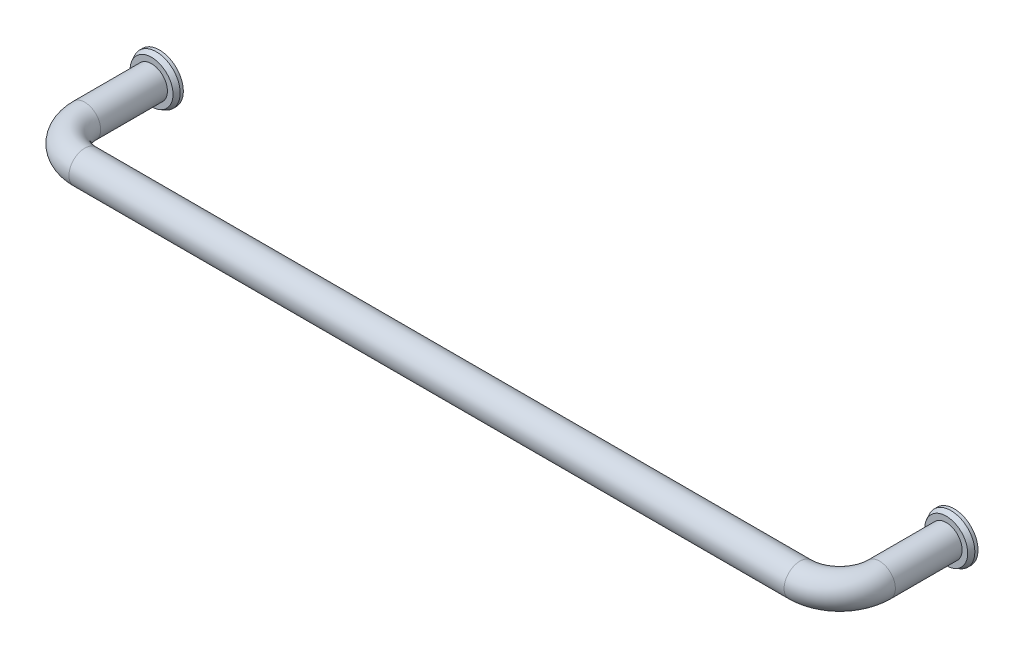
ISO-10303-21;
HEADER;
FILE_DESCRIPTION(('STEP AP214'),'2;1');
FILE_NAME('part.step','',(''),(''),'','','');
FILE_SCHEMA(('AUTOMOTIVE_DESIGN { 1 0 10303 214 1 1 1 1 }'));
ENDSEC;
DATA;
#1=APPLICATION_CONTEXT('core data for automotive mechanical design processes');
#2=APPLICATION_PROTOCOL_DEFINITION('international standard','automotive_design',2000,#1);
#3=PRODUCT_CONTEXT('',#1,'mechanical');
#4=PRODUCT('Part','Part','',(#3));
#5=PRODUCT_RELATED_PRODUCT_CATEGORY('part','',(#4));
#6=PRODUCT_DEFINITION_FORMATION('','',#4);
#7=PRODUCT_DEFINITION_CONTEXT('part definition',#1,'design');
#8=PRODUCT_DEFINITION('design','',#6,#7);
#9=PRODUCT_DEFINITION_SHAPE('','',#8);
#10=(LENGTH_UNIT() NAMED_UNIT(*) SI_UNIT(.MILLI.,.METRE.));
#11=(NAMED_UNIT(*) PLANE_ANGLE_UNIT() SI_UNIT($,.RADIAN.));
#12=(NAMED_UNIT(*) SI_UNIT($,.STERADIAN.) SOLID_ANGLE_UNIT());
#13=UNCERTAINTY_MEASURE_WITH_UNIT(LENGTH_MEASURE(1.E-05),#10,'distance_accuracy_value','');
#14=(GEOMETRIC_REPRESENTATION_CONTEXT(3) GLOBAL_UNCERTAINTY_ASSIGNED_CONTEXT((#13)) GLOBAL_UNIT_ASSIGNED_CONTEXT((#10,
#11,#12)) REPRESENTATION_CONTEXT('',''));
#15=CARTESIAN_POINT('',(0.,0.,0.));
#16=DIRECTION('',(0.,0.,1.));
#17=DIRECTION('',(1.,0.,0.));
#18=AXIS2_PLACEMENT_3D('',#15,#16,#17);
#19=CARTESIAN_POINT('',(0.,0.,0.));
#20=DIRECTION('',(0.,0.,-1.));
#21=DIRECTION('',(0.,1.,0.));
#22=AXIS2_PLACEMENT_3D('',#19,#20,#21);
#23=PLANE('',#22);
#24=CARTESIAN_POINT('',(0.,0.,0.));
#25=DIRECTION('',(0.,0.,1.));
#26=DIRECTION('',(0.,-1.,0.));
#27=AXIS2_PLACEMENT_3D('',#24,#25,#26);
#28=CIRCLE('',#27,7.5);
#29=CARTESIAN_POINT('',(0.,-7.5,0.));
#30=VERTEX_POINT('',#29);
#31=EDGE_CURVE('E56',#30,#30,#28,.T.);
#32=ORIENTED_EDGE('',*,*,#31,.F.);
#33=EDGE_LOOP('',(#32));
#34=FACE_BOUND('',#33,.T.);
#35=CARTESIAN_POINT('',(0.,0.,0.));
#36=DIRECTION('',(0.,0.,1.));
#37=DIRECTION('',(0.,-1.,0.));
#38=AXIS2_PLACEMENT_3D('',#35,#36,#37);
#39=CIRCLE('',#38,2.5);
#40=CARTESIAN_POINT('',(0.,-2.5,0.));
#41=VERTEX_POINT('',#40);
#42=EDGE_CURVE('E62',#41,#41,#39,.T.);
#43=ORIENTED_EDGE('',*,*,#42,.T.);
#44=EDGE_LOOP('',(#43));
#45=FACE_BOUND('',#44,.T.);
#46=ADVANCED_FACE('F12',(#34,#45),#23,.T.);
#47=CARTESIAN_POINT('',(0.,0.,23.5));
#48=DIRECTION('',(0.,0.,-1.));
#49=DIRECTION('',(0.,-1.,0.));
#50=AXIS2_PLACEMENT_3D('',#47,#48,#49);
#51=CYLINDRICAL_SURFACE('',#50,5.);
#52=CARTESIAN_POINT('',(0.,0.,23.5));
#53=DIRECTION('',(0.,0.,-1.));
#54=DIRECTION('',(0.,1.,0.));
#55=AXIS2_PLACEMENT_3D('',#52,#53,#54);
#56=CIRCLE('',#55,5.);
#57=CARTESIAN_POINT('',(-5.,0.,23.5));
#58=VERTEX_POINT('',#57);
#59=EDGE_CURVE('E20',#58,#58,#56,.T.);
#60=ORIENTED_EDGE('',*,*,#59,.T.);
#61=EDGE_LOOP('',(#60));
#62=FACE_BOUND('',#61,.T.);
#63=CARTESIAN_POINT('',(0.,0.,2.5));
#64=DIRECTION('',(0.,0.,-1.));
#65=DIRECTION('',(0.,-1.,0.));
#66=AXIS2_PLACEMENT_3D('',#63,#64,#65);
#67=CIRCLE('',#66,5.);
#68=CARTESIAN_POINT('',(0.,-5.,2.5));
#69=VERTEX_POINT('',#68);
#70=EDGE_CURVE('E16',#69,#69,#67,.F.);
#71=ORIENTED_EDGE('',*,*,#70,.T.);
#72=EDGE_LOOP('',(#71));
#73=FACE_BOUND('',#72,.T.);
#74=ADVANCED_FACE('F14',(#62,#73),#51,.T.);
#75=CARTESIAN_POINT('',(250.,0.,23.5));
#76=DIRECTION('',(0.,0.,-1.));
#77=DIRECTION('',(0.,-1.,0.));
#78=AXIS2_PLACEMENT_3D('',#75,#76,#77);
#79=CYLINDRICAL_SURFACE('',#78,5.);
#80=CARTESIAN_POINT('',(250.,0.,23.5));
#81=DIRECTION('',(0.,0.,1.));
#82=DIRECTION('',(0.,1.,0.));
#83=AXIS2_PLACEMENT_3D('',#80,#81,#82);
#84=CIRCLE('',#83,5.);
#85=CARTESIAN_POINT('',(255.,0.,23.5));
#86=VERTEX_POINT('',#85);
#87=EDGE_CURVE('E32',#86,#86,#84,.T.);
#88=ORIENTED_EDGE('',*,*,#87,.F.);
#89=EDGE_LOOP('',(#88));
#90=FACE_BOUND('',#89,.T.);
#91=CARTESIAN_POINT('',(250.,0.,2.5));
#92=DIRECTION('',(0.,0.,-1.));
#93=DIRECTION('',(0.,-1.,0.));
#94=AXIS2_PLACEMENT_3D('',#91,#92,#93);
#95=CIRCLE('',#94,5.);
#96=CARTESIAN_POINT('',(250.,-5.,2.5));
#97=VERTEX_POINT('',#96);
#98=EDGE_CURVE('E8',#97,#97,#95,.T.);
#99=ORIENTED_EDGE('',*,*,#98,.F.);
#100=EDGE_LOOP('',(#99));
#101=FACE_BOUND('',#100,.T.);
#102=ADVANCED_FACE('F91',(#90,#101),#79,.T.);
#103=CARTESIAN_POINT('',(12.5,0.,23.5));
#104=DIRECTION('',(0.,-1.,0.));
#105=DIRECTION('',(1.,0.,0.));
#106=AXIS2_PLACEMENT_3D('',#103,#104,#105);
#107=TOROIDAL_SURFACE('',#106,12.5,5.);
#108=CARTESIAN_POINT('',(12.5,0.,36.));
#109=DIRECTION('',(-1.,0.,0.));
#110=DIRECTION('',(0.,1.,0.));
#111=AXIS2_PLACEMENT_3D('',#108,#109,#110);
#112=CIRCLE('',#111,5.);
#113=CARTESIAN_POINT('',(12.5,0.,41.));
#114=VERTEX_POINT('',#113);
#115=EDGE_CURVE('E24',#114,#114,#112,.T.);
#116=CARTESIAN_POINT('',(12.5,0.,23.5));
#117=DIRECTION('',(0.,-1.,0.));
#118=DIRECTION('',(1.,0.,0.));
#119=AXIS2_PLACEMENT_3D('',#116,#117,#118);
#120=CIRCLE('',#119,17.5);
#121=EDGE_CURVE('',#114,#58,#120,.T.);
#122=ORIENTED_EDGE('',*,*,#115,.T.);
#123=ORIENTED_EDGE('',*,*,#59,.F.);
#124=ORIENTED_EDGE('',*,*,#121,.T.);
#125=ORIENTED_EDGE('',*,*,#121,.F.);
#126=EDGE_LOOP('',(#122,#124,#123,#125));
#127=FACE_BOUND('',#126,.T.);
#128=ADVANCED_FACE('F100',(#127),#107,.T.);
#129=CARTESIAN_POINT('',(237.5,0.,36.));
#130=DIRECTION('',(-1.,0.,0.));
#131=DIRECTION('',(0.,-1.,0.));
#132=AXIS2_PLACEMENT_3D('',#129,#130,#131);
#133=CYLINDRICAL_SURFACE('',#132,5.);
#134=CARTESIAN_POINT('',(237.5,0.,36.));
#135=DIRECTION('',(-1.,0.,0.));
#136=DIRECTION('',(0.,1.,0.));
#137=AXIS2_PLACEMENT_3D('',#134,#135,#136);
#138=CIRCLE('',#137,5.);
#139=CARTESIAN_POINT('',(237.5,0.,41.));
#140=VERTEX_POINT('',#139);
#141=EDGE_CURVE('E29',#140,#140,#138,.T.);
#142=ORIENTED_EDGE('',*,*,#141,.T.);
#143=EDGE_LOOP('',(#142));
#144=FACE_BOUND('',#143,.T.);
#145=ORIENTED_EDGE('',*,*,#115,.F.);
#146=EDGE_LOOP('',(#145));
#147=FACE_BOUND('',#146,.T.);
#148=ADVANCED_FACE('F106',(#144,#147),#133,.T.);
#149=CARTESIAN_POINT('',(237.5,0.,23.5));
#150=DIRECTION('',(0.,-1.,0.));
#151=DIRECTION('',(1.,0.,0.));
#152=AXIS2_PLACEMENT_3D('',#149,#150,#151);
#153=TOROIDAL_SURFACE('',#152,12.5,5.);
#154=CARTESIAN_POINT('',(237.5,0.,23.5));
#155=DIRECTION('',(0.,-1.,0.));
#156=DIRECTION('',(1.,0.,0.));
#157=AXIS2_PLACEMENT_3D('',#154,#155,#156);
#158=CIRCLE('',#157,17.5);
#159=EDGE_CURVE('',#86,#140,#158,.T.);
#160=ORIENTED_EDGE('',*,*,#87,.T.);
#161=ORIENTED_EDGE('',*,*,#141,.F.);
#162=ORIENTED_EDGE('',*,*,#159,.T.);
#163=ORIENTED_EDGE('',*,*,#159,.F.);
#164=EDGE_LOOP('',(#160,#162,#161,#163));
#165=FACE_BOUND('',#164,.T.);
#166=ADVANCED_FACE('F102',(#165),#153,.T.);
#167=CARTESIAN_POINT('',(250.,0.,2.5));
#168=DIRECTION('',(0.,0.,-1.));
#169=DIRECTION('',(0.,-1.,0.));
#170=AXIS2_PLACEMENT_3D('',#167,#168,#169);
#171=PLANE('',#170);
#172=CARTESIAN_POINT('',(250.,0.,2.5));
#173=DIRECTION('',(0.,0.,-1.));
#174=DIRECTION('',(0.,-1.,0.));
#175=AXIS2_PLACEMENT_3D('',#172,#173,#174);
#176=CIRCLE('',#175,6.75);
#177=CARTESIAN_POINT('',(250.,-6.75,2.5));
#178=VERTEX_POINT('',#177);
#179=EDGE_CURVE('E35',#178,#178,#176,.T.);
#180=ORIENTED_EDGE('',*,*,#179,.F.);
#181=EDGE_LOOP('',(#180));
#182=FACE_BOUND('',#181,.T.);
#183=ORIENTED_EDGE('',*,*,#98,.T.);
#184=EDGE_LOOP('',(#183));
#185=FACE_BOUND('',#184,.T.);
#186=ADVANCED_FACE('F105',(#182,#185),#171,.F.);
#187=CARTESIAN_POINT('',(250.,0.,2.5));
#188=DIRECTION('',(0.,0.,-1.));
#189=DIRECTION('',(0.,-1.,0.));
#190=AXIS2_PLACEMENT_3D('',#187,#188,#189);
#191=CONICAL_SURFACE('',#190,6.75,0.463647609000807);
#192=CARTESIAN_POINT('',(250.,0.,0.999999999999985));
#193=DIRECTION('',(0.,0.,-1.));
#194=DIRECTION('',(0.,-1.,0.));
#195=AXIS2_PLACEMENT_3D('',#192,#193,#194);
#196=CIRCLE('',#195,7.5);
#197=CARTESIAN_POINT('',(250.,-7.5,0.999999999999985));
#198=VERTEX_POINT('',#197);
#199=EDGE_CURVE('E38',#198,#198,#196,.T.);
#200=ORIENTED_EDGE('',*,*,#199,.F.);
#201=EDGE_LOOP('',(#200));
#202=FACE_BOUND('',#201,.T.);
#203=ORIENTED_EDGE('',*,*,#179,.T.);
#204=EDGE_LOOP('',(#203));
#205=FACE_BOUND('',#204,.T.);
#206=ADVANCED_FACE('F146',(#202,#205),#191,.T.);
#207=CARTESIAN_POINT('',(250.,0.,0.));
#208=DIRECTION('',(0.,0.,-1.));
#209=DIRECTION('',(0.,-1.,0.));
#210=AXIS2_PLACEMENT_3D('',#207,#208,#209);
#211=CYLINDRICAL_SURFACE('',#210,7.5);
#212=CARTESIAN_POINT('',(250.,0.,0.));
#213=DIRECTION('',(0.,0.,-1.));
#214=DIRECTION('',(0.,-1.,0.));
#215=AXIS2_PLACEMENT_3D('',#212,#213,#214);
#216=CIRCLE('',#215,7.5);
#217=CARTESIAN_POINT('',(250.,-7.5,0.));
#218=VERTEX_POINT('',#217);
#219=EDGE_CURVE('E41',#218,#218,#216,.T.);
#220=ORIENTED_EDGE('',*,*,#219,.F.);
#221=EDGE_LOOP('',(#220));
#222=FACE_BOUND('',#221,.T.);
#223=ORIENTED_EDGE('',*,*,#199,.T.);
#224=EDGE_LOOP('',(#223));
#225=FACE_BOUND('',#224,.T.);
#226=ADVANCED_FACE('F143',(#222,#225),#211,.T.);
#227=CARTESIAN_POINT('',(250.,0.,0.));
#228=DIRECTION('',(0.,0.,1.));
#229=DIRECTION('',(0.,1.,0.));
#230=AXIS2_PLACEMENT_3D('',#227,#228,#229);
#231=PLANE('',#230);
#232=CARTESIAN_POINT('',(250.,0.,0.));
#233=DIRECTION('',(0.,0.,-1.));
#234=DIRECTION('',(0.,-1.,0.));
#235=AXIS2_PLACEMENT_3D('',#232,#233,#234);
#236=CIRCLE('',#235,2.5);
#237=CARTESIAN_POINT('',(250.,-2.5,0.));
#238=VERTEX_POINT('',#237);
#239=EDGE_CURVE('E47',#238,#238,#236,.T.);
#240=ORIENTED_EDGE('',*,*,#239,.F.);
#241=EDGE_LOOP('',(#240));
#242=FACE_BOUND('',#241,.T.);
#243=ORIENTED_EDGE('',*,*,#219,.T.);
#244=EDGE_LOOP('',(#243));
#245=FACE_BOUND('',#244,.T.);
#246=ADVANCED_FACE('F96',(#242,#245),#231,.F.);
#247=CARTESIAN_POINT('',(250.,0.,11.));
#248=DIRECTION('',(0.,0.,-1.));
#249=DIRECTION('',(0.,-1.,0.));
#250=AXIS2_PLACEMENT_3D('',#247,#248,#249);
#251=CYLINDRICAL_SURFACE('',#250,2.5);
#252=CARTESIAN_POINT('',(250.,0.,11.));
#253=DIRECTION('',(0.,0.,-1.));
#254=DIRECTION('',(0.,-1.,0.));
#255=AXIS2_PLACEMENT_3D('',#252,#253,#254);
#256=CIRCLE('',#255,2.5);
#257=CARTESIAN_POINT('',(250.,-2.5,11.));
#258=VERTEX_POINT('',#257);
#259=EDGE_CURVE('E44',#258,#258,#256,.T.);
#260=ORIENTED_EDGE('',*,*,#259,.F.);
#261=EDGE_LOOP('',(#260));
#262=FACE_BOUND('',#261,.T.);
#263=ORIENTED_EDGE('',*,*,#239,.T.);
#264=EDGE_LOOP('',(#263));
#265=FACE_BOUND('',#264,.T.);
#266=ADVANCED_FACE('F127',(#262,#265),#251,.F.);
#267=CARTESIAN_POINT('',(250.,0.,11.));
#268=DIRECTION('',(0.,0.,-1.));
#269=DIRECTION('',(0.,-1.,0.));
#270=AXIS2_PLACEMENT_3D('',#267,#268,#269);
#271=PLANE('',#270);
#272=ORIENTED_EDGE('',*,*,#259,.T.);
#273=EDGE_LOOP('',(#272));
#274=FACE_BOUND('',#273,.T.);
#275=ADVANCED_FACE('F125',(#274),#271,.T.);
#276=CARTESIAN_POINT('',(0.,0.,2.5));
#277=DIRECTION('',(0.,0.,-1.));
#278=DIRECTION('',(0.,-1.,0.));
#279=AXIS2_PLACEMENT_3D('',#276,#277,#278);
#280=PLANE('',#279);
#281=ORIENTED_EDGE('',*,*,#70,.F.);
#282=EDGE_LOOP('',(#281));
#283=FACE_BOUND('',#282,.T.);
#284=CARTESIAN_POINT('',(0.,0.,2.5));
#285=DIRECTION('',(0.,0.,1.));
#286=DIRECTION('',(0.,-1.,0.));
#287=AXIS2_PLACEMENT_3D('',#284,#285,#286);
#288=CIRCLE('',#287,6.75);
#289=CARTESIAN_POINT('',(0.,-6.75,2.5));
#290=VERTEX_POINT('',#289);
#291=EDGE_CURVE('E50',#290,#290,#288,.T.);
#292=ORIENTED_EDGE('',*,*,#291,.T.);
#293=EDGE_LOOP('',(#292));
#294=FACE_BOUND('',#293,.T.);
#295=ADVANCED_FACE('F122',(#283,#294),#280,.F.);
#296=CARTESIAN_POINT('',(0.,0.,2.5));
#297=DIRECTION('',(0.,0.,-1.));
#298=DIRECTION('',(0.,-1.,0.));
#299=AXIS2_PLACEMENT_3D('',#296,#297,#298);
#300=CONICAL_SURFACE('',#299,6.75,0.463647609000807);
#301=CARTESIAN_POINT('',(0.,0.,0.999999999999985));
#302=DIRECTION('',(0.,0.,1.));
#303=DIRECTION('',(0.,-1.,0.));
#304=AXIS2_PLACEMENT_3D('',#301,#302,#303);
#305=CIRCLE('',#304,7.5);
#306=CARTESIAN_POINT('',(0.,-7.5,0.999999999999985));
#307=VERTEX_POINT('',#306);
#308=EDGE_CURVE('E53',#307,#307,#305,.T.);
#309=ORIENTED_EDGE('',*,*,#308,.T.);
#310=EDGE_LOOP('',(#309));
#311=FACE_BOUND('',#310,.T.);
#312=ORIENTED_EDGE('',*,*,#291,.F.);
#313=EDGE_LOOP('',(#312));
#314=FACE_BOUND('',#313,.T.);
#315=ADVANCED_FACE('F81',(#311,#314),#300,.T.);
#316=CARTESIAN_POINT('',(0.,0.,0.));
#317=DIRECTION('',(0.,0.,-1.));
#318=DIRECTION('',(0.,-1.,0.));
#319=AXIS2_PLACEMENT_3D('',#316,#317,#318);
#320=CYLINDRICAL_SURFACE('',#319,7.5);
#321=ORIENTED_EDGE('',*,*,#31,.T.);
#322=EDGE_LOOP('',(#321));
#323=FACE_BOUND('',#322,.T.);
#324=ORIENTED_EDGE('',*,*,#308,.F.);
#325=EDGE_LOOP('',(#324));
#326=FACE_BOUND('',#325,.T.);
#327=ADVANCED_FACE('F70',(#323,#326),#320,.T.);
#328=CARTESIAN_POINT('',(0.,0.,11.));
#329=DIRECTION('',(0.,0.,-1.));
#330=DIRECTION('',(0.,-1.,0.));
#331=AXIS2_PLACEMENT_3D('',#328,#329,#330);
#332=CYLINDRICAL_SURFACE('',#331,2.5);
#333=CARTESIAN_POINT('',(0.,0.,11.));
#334=DIRECTION('',(0.,0.,1.));
#335=DIRECTION('',(0.,-1.,0.));
#336=AXIS2_PLACEMENT_3D('',#333,#334,#335);
#337=CIRCLE('',#336,2.5);
#338=CARTESIAN_POINT('',(0.,-2.5,11.));
#339=VERTEX_POINT('',#338);
#340=EDGE_CURVE('E59',#339,#339,#337,.T.);
#341=ORIENTED_EDGE('',*,*,#340,.T.);
#342=EDGE_LOOP('',(#341));
#343=FACE_BOUND('',#342,.T.);
#344=ORIENTED_EDGE('',*,*,#42,.F.);
#345=EDGE_LOOP('',(#344));
#346=FACE_BOUND('',#345,.T.);
#347=ADVANCED_FACE('F67',(#343,#346),#332,.F.);
#348=CARTESIAN_POINT('',(0.,0.,11.));
#349=DIRECTION('',(0.,0.,-1.));
#350=DIRECTION('',(0.,-1.,0.));
#351=AXIS2_PLACEMENT_3D('',#348,#349,#350);
#352=PLANE('',#351);
#353=ORIENTED_EDGE('',*,*,#340,.F.);
#354=EDGE_LOOP('',(#353));
#355=FACE_BOUND('',#354,.T.);
#356=ADVANCED_FACE('F69',(#355),#352,.T.);
#357=CLOSED_SHELL('',(#46,#74,#102,#128,#148,#166,#186,#206,#226,#246,#266,#275,#295,#315,#327,
#347,#356));
#358=MANIFOLD_SOLID_BREP('B1',#357);
#359=ADVANCED_BREP_SHAPE_REPRESENTATION('',(#18,#358),#14);
#360=SHAPE_DEFINITION_REPRESENTATION(#9,#359);
ENDSEC;
END-ISO-10303-21;
